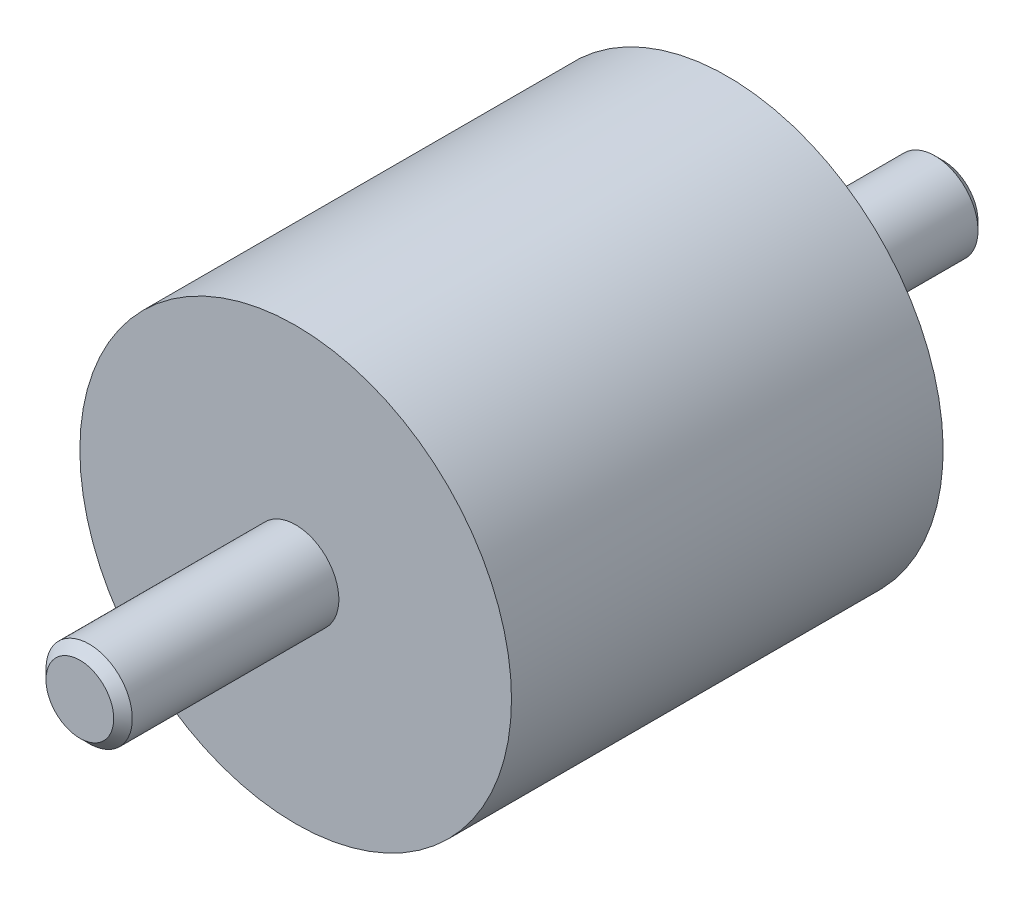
ISO-10303-21;
HEADER;
FILE_DESCRIPTION(('STEP AP214'),'2;1');
FILE_NAME('part.step','',(''),(''),'','','');
FILE_SCHEMA(('AUTOMOTIVE_DESIGN { 1 0 10303 214 1 1 1 1 }'));
ENDSEC;
DATA;
#1=APPLICATION_CONTEXT('core data for automotive mechanical design processes');
#2=APPLICATION_PROTOCOL_DEFINITION('international standard','automotive_design',2000,#1);
#3=PRODUCT_CONTEXT('',#1,'mechanical');
#4=PRODUCT('Part','Part','',(#3));
#5=PRODUCT_RELATED_PRODUCT_CATEGORY('part','',(#4));
#6=PRODUCT_DEFINITION_FORMATION('','',#4);
#7=PRODUCT_DEFINITION_CONTEXT('part definition',#1,'design');
#8=PRODUCT_DEFINITION('design','',#6,#7);
#9=PRODUCT_DEFINITION_SHAPE('','',#8);
#10=(LENGTH_UNIT() NAMED_UNIT(*) SI_UNIT(.MILLI.,.METRE.));
#11=(NAMED_UNIT(*) PLANE_ANGLE_UNIT() SI_UNIT($,.RADIAN.));
#12=(NAMED_UNIT(*) SI_UNIT($,.STERADIAN.) SOLID_ANGLE_UNIT());
#13=UNCERTAINTY_MEASURE_WITH_UNIT(LENGTH_MEASURE(1.E-05),#10,'distance_accuracy_value','');
#14=(GEOMETRIC_REPRESENTATION_CONTEXT(3) GLOBAL_UNCERTAINTY_ASSIGNED_CONTEXT((#13)) GLOBAL_UNIT_ASSIGNED_CONTEXT((#10,
#11,#12)) REPRESENTATION_CONTEXT('',''));
#15=CARTESIAN_POINT('',(0.,0.,0.));
#16=DIRECTION('',(0.,0.,1.));
#17=DIRECTION('',(1.,0.,0.));
#18=AXIS2_PLACEMENT_3D('',#15,#16,#17);
#19=CARTESIAN_POINT('',(0.,0.,0.66666666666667));
#20=DIRECTION('',(0.,0.,1.));
#21=DIRECTION('',(0.,-1.,0.));
#22=AXIS2_PLACEMENT_3D('',#19,#20,#21);
#23=CYLINDRICAL_SURFACE('',#22,20.);
#24=CARTESIAN_POINT('',(0.,0.,0.));
#25=DIRECTION('',(0.,0.,1.));
#26=DIRECTION('',(0.,-1.,0.));
#27=AXIS2_PLACEMENT_3D('',#24,#25,#26);
#28=CIRCLE('',#27,20.);
#29=CARTESIAN_POINT('',(0.,-20.,0.));
#30=VERTEX_POINT('',#29);
#31=EDGE_CURVE('E18',#30,#30,#28,.T.);
#32=ORIENTED_EDGE('',*,*,#31,.T.);
#33=EDGE_LOOP('',(#32));
#34=FACE_BOUND('',#33,.T.);
#35=CARTESIAN_POINT('',(0.,0.,40.));
#36=DIRECTION('',(0.,0.,-1.));
#37=DIRECTION('',(-1.,0.,0.));
#38=AXIS2_PLACEMENT_3D('',#35,#36,#37);
#39=CIRCLE('',#38,20.);
#40=CARTESIAN_POINT('',(-20.,0.,40.));
#41=VERTEX_POINT('',#40);
#42=EDGE_CURVE('E31',#41,#41,#39,.T.);
#43=ORIENTED_EDGE('',*,*,#42,.T.);
#44=EDGE_LOOP('',(#43));
#45=FACE_BOUND('',#44,.T.);
#46=ADVANCED_FACE('F12',(#34,#45),#23,.T.);
#47=CARTESIAN_POINT('',(20.,0.,0.));
#48=DIRECTION('',(0.,0.,-1.));
#49=DIRECTION('',(0.,1.,0.));
#50=AXIS2_PLACEMENT_3D('',#47,#48,#49);
#51=PLANE('',#50);
#52=CARTESIAN_POINT('',(0.,0.,0.));
#53=DIRECTION('',(0.,0.,-1.));
#54=DIRECTION('',(0.,1.,0.));
#55=AXIS2_PLACEMENT_3D('',#52,#53,#54);
#56=CIRCLE('',#55,4.);
#57=CARTESIAN_POINT('',(0.,4.,0.));
#58=VERTEX_POINT('',#57);
#59=EDGE_CURVE('E8',#58,#58,#56,.T.);
#60=ORIENTED_EDGE('',*,*,#59,.F.);
#61=EDGE_LOOP('',(#60));
#62=FACE_BOUND('',#61,.T.);
#63=ORIENTED_EDGE('',*,*,#31,.F.);
#64=EDGE_LOOP('',(#63));
#65=FACE_BOUND('',#64,.T.);
#66=ADVANCED_FACE('F57',(#62,#65),#51,.T.);
#67=CARTESIAN_POINT('',(0.,0.,-20.));
#68=DIRECTION('',(0.,0.,1.));
#69=DIRECTION('',(0.,-1.,0.));
#70=AXIS2_PLACEMENT_3D('',#67,#68,#69);
#71=CYLINDRICAL_SURFACE('',#70,4.);
#72=CARTESIAN_POINT('',(0.,0.,-19.233));
#73=DIRECTION('',(0.,0.,1.));
#74=DIRECTION('',(0.,-1.,0.));
#75=AXIS2_PLACEMENT_3D('',#72,#73,#74);
#76=CIRCLE('',#75,4.);
#77=CARTESIAN_POINT('',(0.,-4.,-19.233));
#78=VERTEX_POINT('',#77);
#79=EDGE_CURVE('E22',#78,#78,#76,.T.);
#80=ORIENTED_EDGE('',*,*,#79,.T.);
#81=EDGE_LOOP('',(#80));
#82=FACE_BOUND('',#81,.T.);
#83=ORIENTED_EDGE('',*,*,#59,.T.);
#84=EDGE_LOOP('',(#83));
#85=FACE_BOUND('',#84,.T.);
#86=ADVANCED_FACE('F61',(#82,#85),#71,.T.);
#87=CARTESIAN_POINT('',(0.,0.,-19.233));
#88=DIRECTION('',(0.,0.,1.));
#89=DIRECTION('',(0.,-1.,0.));
#90=AXIS2_PLACEMENT_3D('',#87,#88,#89);
#91=CONICAL_SURFACE('',#90,4.,0.785398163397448);
#92=CARTESIAN_POINT('',(0.,0.,-20.));
#93=DIRECTION('',(0.,0.,1.));
#94=DIRECTION('',(0.,-1.,0.));
#95=AXIS2_PLACEMENT_3D('',#92,#93,#94);
#96=CIRCLE('',#95,3.233);
#97=CARTESIAN_POINT('',(0.,-3.233,-20.));
#98=VERTEX_POINT('',#97);
#99=EDGE_CURVE('E26',#98,#98,#96,.T.);
#100=ORIENTED_EDGE('',*,*,#99,.T.);
#101=EDGE_LOOP('',(#100));
#102=FACE_BOUND('',#101,.T.);
#103=ORIENTED_EDGE('',*,*,#79,.F.);
#104=EDGE_LOOP('',(#103));
#105=FACE_BOUND('',#104,.T.);
#106=ADVANCED_FACE('F77',(#102,#105),#91,.T.);
#107=CARTESIAN_POINT('',(3.233,0.,-20.));
#108=DIRECTION('',(0.,0.,-1.));
#109=DIRECTION('',(0.,1.,0.));
#110=AXIS2_PLACEMENT_3D('',#107,#108,#109);
#111=PLANE('',#110);
#112=ORIENTED_EDGE('',*,*,#99,.F.);
#113=EDGE_LOOP('',(#112));
#114=FACE_BOUND('',#113,.T.);
#115=ADVANCED_FACE('F68',(#114),#111,.T.);
#116=CARTESIAN_POINT('',(0.,20.,40.));
#117=DIRECTION('',(0.,0.,1.));
#118=DIRECTION('',(1.,0.,0.));
#119=AXIS2_PLACEMENT_3D('',#116,#117,#118);
#120=PLANE('',#119);
#121=CARTESIAN_POINT('',(0.,0.,40.));
#122=DIRECTION('',(0.,0.,-1.));
#123=DIRECTION('',(-1.,0.,0.));
#124=AXIS2_PLACEMENT_3D('',#121,#122,#123);
#125=CIRCLE('',#124,4.);
#126=CARTESIAN_POINT('',(-4.,0.,40.));
#127=VERTEX_POINT('',#126);
#128=EDGE_CURVE('E34',#127,#127,#125,.T.);
#129=ORIENTED_EDGE('',*,*,#128,.T.);
#130=EDGE_LOOP('',(#129));
#131=FACE_BOUND('',#130,.T.);
#132=ORIENTED_EDGE('',*,*,#42,.F.);
#133=EDGE_LOOP('',(#132));
#134=FACE_BOUND('',#133,.T.);
#135=ADVANCED_FACE('F66',(#131,#134),#120,.T.);
#136=CARTESIAN_POINT('',(0.,0.,-30.0225910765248));
#137=DIRECTION('',(0.,0.,-1.));
#138=DIRECTION('',(-1.,0.,0.));
#139=AXIS2_PLACEMENT_3D('',#136,#137,#138);
#140=CYLINDRICAL_SURFACE('',#139,4.);
#141=CARTESIAN_POINT('',(0.,0.,59.1378626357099));
#142=DIRECTION('',(0.,0.,-1.));
#143=DIRECTION('',(-1.,0.,0.));
#144=AXIS2_PLACEMENT_3D('',#141,#142,#143);
#145=CIRCLE('',#144,4.);
#146=CARTESIAN_POINT('',(-4.,0.,59.1378626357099));
#147=VERTEX_POINT('',#146);
#148=EDGE_CURVE('E37',#147,#147,#145,.T.);
#149=ORIENTED_EDGE('',*,*,#148,.T.);
#150=EDGE_LOOP('',(#149));
#151=FACE_BOUND('',#150,.T.);
#152=ORIENTED_EDGE('',*,*,#128,.F.);
#153=EDGE_LOOP('',(#152));
#154=FACE_BOUND('',#153,.T.);
#155=ADVANCED_FACE('F54',(#151,#154),#140,.T.);
#156=CARTESIAN_POINT('',(0.,0.,59.1378626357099));
#157=DIRECTION('',(0.,0.,-1.));
#158=DIRECTION('',(-1.,0.,0.));
#159=AXIS2_PLACEMENT_3D('',#156,#157,#158);
#160=CONICAL_SURFACE('',#159,4.,0.785398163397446);
#161=CARTESIAN_POINT('',(0.,0.,60.));
#162=DIRECTION('',(0.,0.,-1.));
#163=DIRECTION('',(-1.,0.,0.));
#164=AXIS2_PLACEMENT_3D('',#161,#162,#163);
#165=CIRCLE('',#164,3.13786263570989);
#166=CARTESIAN_POINT('',(-3.13786263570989,0.,60.));
#167=VERTEX_POINT('',#166);
#168=EDGE_CURVE('E40',#167,#167,#165,.T.);
#169=ORIENTED_EDGE('',*,*,#168,.T.);
#170=EDGE_LOOP('',(#169));
#171=FACE_BOUND('',#170,.T.);
#172=ORIENTED_EDGE('',*,*,#148,.F.);
#173=EDGE_LOOP('',(#172));
#174=FACE_BOUND('',#173,.T.);
#175=ADVANCED_FACE('F44',(#171,#174),#160,.T.);
#176=CARTESIAN_POINT('',(0.,3.13786263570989,60.));
#177=DIRECTION('',(0.,0.,1.));
#178=DIRECTION('',(1.,0.,0.));
#179=AXIS2_PLACEMENT_3D('',#176,#177,#178);
#180=PLANE('',#179);
#181=ORIENTED_EDGE('',*,*,#168,.F.);
#182=EDGE_LOOP('',(#181));
#183=FACE_BOUND('',#182,.T.);
#184=ADVANCED_FACE('F47',(#183),#180,.T.);
#185=CLOSED_SHELL('',(#46,#66,#86,#106,#115,#135,#155,#175,#184));
#186=MANIFOLD_SOLID_BREP('B1',#185);
#187=ADVANCED_BREP_SHAPE_REPRESENTATION('',(#18,#186),#14);
#188=SHAPE_DEFINITION_REPRESENTATION(#9,#187);
ENDSEC;
END-ISO-10303-21;
